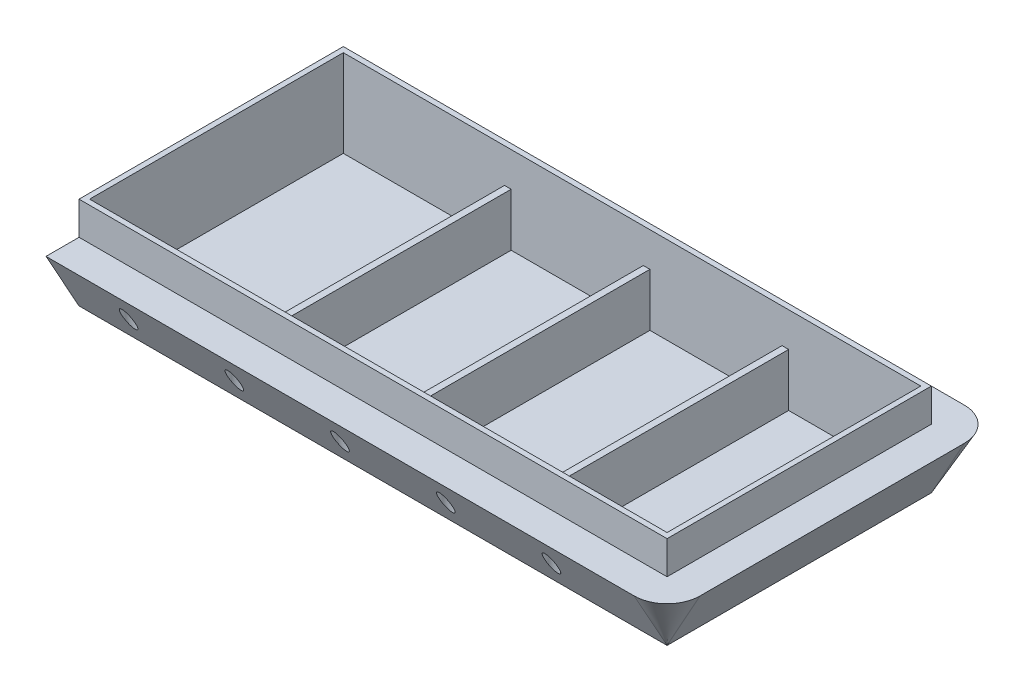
from build123d import *

# Parameters (mm, degrees)
SKETCH1_W           = 445
SKETCH1_H           = 200
SKETCH1_W_2         = 437
SKETCH1_H_2         = 192
BOSS_EXTRUDE1_DEPTH = 70
SKETCH2_W           = 445
SKETCH2_H           = 4
BOSS_EXTRUDE2_DEPTH = 192
BOSS_EXTRUDE3_DEPTH = 445
SKETCH4_R           = 5
CUT_EXTRUDE1_DEPTH  = 30
BOSS_EXTRUDE4_DEPTH = 200
SKETCH8_W           = 50
SKETCH8_H           = 192
CUT_EXTRUDE2_DEPTH  = 66
SKETCH9_W           = 5
SKETCH9_H           = 192
BOSS_EXTRUDE5_DEPTH = 40


with BuildPart() as part:
    # Sketch1 → Boss-Extrude1 (new body)
    with BuildSketch(Plane(origin=(0, 0, 0), x_dir=(1, 0, 0), z_dir=(0, 1, 0))):
        Rectangle(SKETCH1_W, SKETCH1_H)
        Rectangle(SKETCH1_W_2, SKETCH1_H_2, mode=Mode.SUBTRACT)
    extrude(amount=BOSS_EXTRUDE1_DEPTH)

    # Sketch2 → Boss-Extrude2 (add)
    with BuildSketch(Plane.XY.offset(-96)):
        with Locations((0, 2)):
            Rectangle(SKETCH2_W, SKETCH2_H)
    extrude(amount=BOSS_EXTRUDE2_DEPTH)

    # Sketch3 → Boss-Extrude3 (add)
    with BuildSketch(Plane.ZY.offset(222.5)):
        Polygon((100, 45), (125, 45), (100, 0), align=None)
    boss_extrude3 = extrude(amount=-BOSS_EXTRUDE3_DEPTH)

    # Mirror1: Boss-Extrude3 across plane
    add(boss_extrude3.mirror(Plane.XY))

    # Sketch4 → Cut-Extrude1 (cut)
    with BuildSketch(Plane(origin=(0, 40, 0), x_dir=(1, 0, 0), z_dir=(0, 1, 0))):
        with Locations(Location((-172.5, 112.5, 0), (0, 0, 270))):
            Circle(SKETCH4_R)
        with Locations(Location((-92.5, 112.5, 0), (0, 0, 270))):
            Circle(SKETCH4_R)
        with Locations(Location((-12.5, 112.5, 0), (0, 0, 270))):
            Circle(SKETCH4_R)
        with Locations(Location((67.5, 112.5, 0), (0, 0, 270))):
            Circle(SKETCH4_R)
        with Locations(Location((147.5, 112.5, 0), (0, 0, 270))):
            Circle(SKETCH4_R)
        with Locations(Location((147.5, -112.5, 0), (0, 0, 270))):
            Circle(SKETCH4_R)
        with Locations(Location((67.5, -112.5, 0), (0, 0, 270))):
            Circle(SKETCH4_R)
        with Locations(Location((-12.5, -112.5, 0), (0, 0, 270))):
            Circle(SKETCH4_R)
        with Locations(Location((-172.5, -112.5, 0), (0, 0, 270))):
            Circle(SKETCH4_R)
        with Locations(Location((-92.5, -112.5, 0), (0, 0, 270))):
            Circle(SKETCH4_R)
    extrude(amount=-CUT_EXTRUDE1_DEPTH, mode=Mode.SUBTRACT)

    # Sketch5 → Boss-Extrude4 (add)
    with BuildSketch(Plane.XY.offset(100)):
        Polygon((222.5, 0), (222.5, 45), (247.5, 45), align=None)
    extrude(amount=-BOSS_EXTRUDE4_DEPTH)

    # Sketch7 → Revolve1 (revolve)
    with BuildSketch(Plane(origin=(222.5, 0, 0), x_dir=(0, 0, -1), z_dir=(1, 0, 0))):
        Polygon((-100, 0), (-100, 45), (-125, 45), align=None)
    revolve1 = revolve(axis=Axis((222.5, 0, 100), (0, 1, 0)))

    # Mirror2: Revolve1 across plane
    add(revolve1.mirror(Plane.XY))

    # Sketch8 → Cut-Extrude2 (cut)
    with BuildSketch(Plane(origin=(0, 70, 0), x_dir=(1, 0, 0), z_dir=(0, 1, 0))):
        with Locations((193.5, 0)):
            Rectangle(SKETCH8_W, SKETCH8_H)
    extrude(amount=-CUT_EXTRUDE2_DEPTH, mode=Mode.SUBTRACT)

    # Sketch9 → Boss-Extrude5 (add)
    with BuildSketch(Plane(origin=(0, 4, 0), x_dir=(1, 0, 0), z_dir=(0, 1, 0))):
        with Locations((116, 0)):
            Rectangle(SKETCH9_W, SKETCH9_H)
        with Locations((11, 0)):
            Rectangle(SKETCH9_W, SKETCH9_H)
        with Locations((-94, 0)):
            Rectangle(SKETCH9_W, SKETCH9_H)
    extrude(amount=BOSS_EXTRUDE5_DEPTH)


solid = part.part
